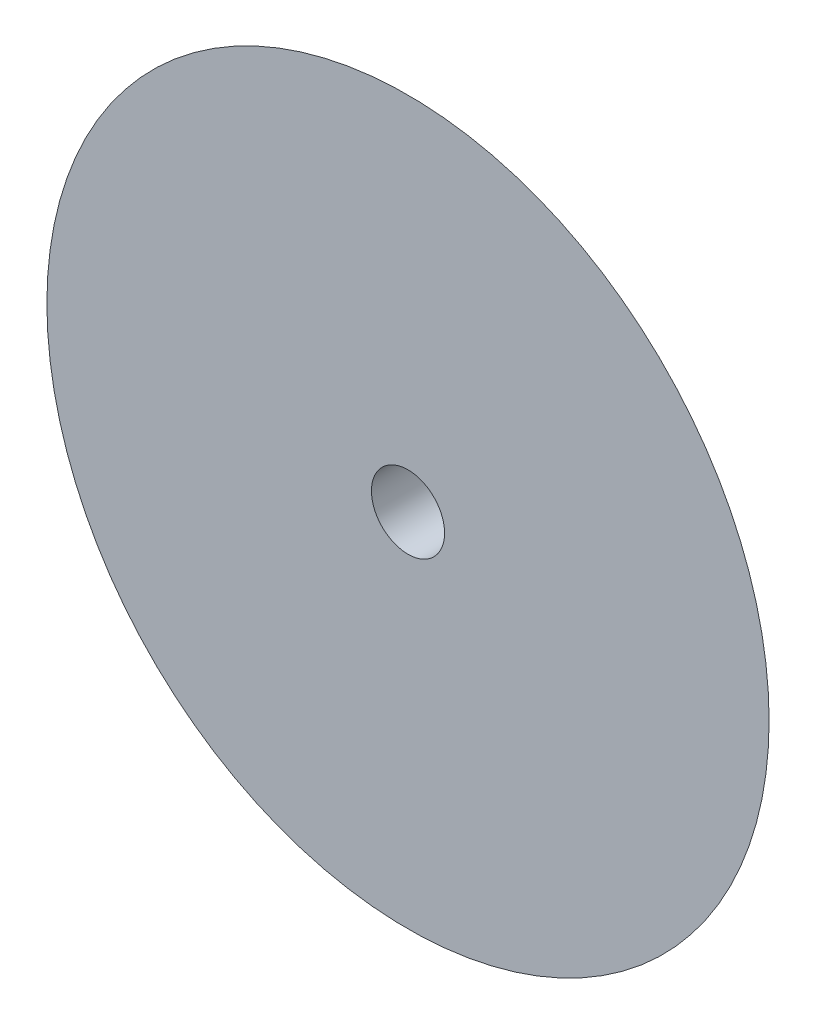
ISO-10303-21;
HEADER;
FILE_DESCRIPTION(('STEP AP214'),'2;1');
FILE_NAME('part.step','',(''),(''),'','','');
FILE_SCHEMA(('AUTOMOTIVE_DESIGN { 1 0 10303 214 1 1 1 1 }'));
ENDSEC;
DATA;
#1=APPLICATION_CONTEXT('core data for automotive mechanical design processes');
#2=APPLICATION_PROTOCOL_DEFINITION('international standard','automotive_design',2000,#1);
#3=PRODUCT_CONTEXT('',#1,'mechanical');
#4=PRODUCT('Part','Part','',(#3));
#5=PRODUCT_RELATED_PRODUCT_CATEGORY('part','',(#4));
#6=PRODUCT_DEFINITION_FORMATION('','',#4);
#7=PRODUCT_DEFINITION_CONTEXT('part definition',#1,'design');
#8=PRODUCT_DEFINITION('design','',#6,#7);
#9=PRODUCT_DEFINITION_SHAPE('','',#8);
#10=(LENGTH_UNIT() NAMED_UNIT(*) SI_UNIT(.MILLI.,.METRE.));
#11=(NAMED_UNIT(*) PLANE_ANGLE_UNIT() SI_UNIT($,.RADIAN.));
#12=(NAMED_UNIT(*) SI_UNIT($,.STERADIAN.) SOLID_ANGLE_UNIT());
#13=UNCERTAINTY_MEASURE_WITH_UNIT(LENGTH_MEASURE(1.E-05),#10,'distance_accuracy_value','');
#14=(GEOMETRIC_REPRESENTATION_CONTEXT(3) GLOBAL_UNCERTAINTY_ASSIGNED_CONTEXT((#13)) GLOBAL_UNIT_ASSIGNED_CONTEXT((#10,
#11,#12)) REPRESENTATION_CONTEXT('',''));
#15=CARTESIAN_POINT('',(0.,0.,0.));
#16=DIRECTION('',(0.,0.,1.));
#17=DIRECTION('',(1.,0.,0.));
#18=AXIS2_PLACEMENT_3D('',#15,#16,#17);
#19=CARTESIAN_POINT('',(0.,0.,36.6743948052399));
#20=DIRECTION('',(0.,0.,1.));
#21=DIRECTION('',(1.,0.,0.));
#22=AXIS2_PLACEMENT_3D('',#19,#20,#21);
#23=DEGENERATE_TOROIDAL_SURFACE('',#22,1.30305823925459,44.45,.F.);
#24=CARTESIAN_POINT('',(0.,0.,0.));
#25=DIRECTION('',(0.,0.,1.));
#26=DIRECTION('',(1.,0.,0.));
#27=AXIS2_PLACEMENT_3D('',#24,#25,#26);
#28=CIRCLE('',#27,23.8125);
#29=CARTESIAN_POINT('',(23.8125,0.,0.));
#30=VERTEX_POINT('',#29);
#31=EDGE_CURVE('E38',#30,#30,#28,.T.);
#32=ORIENTED_EDGE('',*,*,#31,.F.);
#33=EDGE_LOOP('',(#32));
#34=FACE_BOUND('',#33,.T.);
#35=CARTESIAN_POINT('',(0.,0.,-7.35981352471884));
#36=DIRECTION('',(0.,0.,1.));
#37=DIRECTION('',(1.,0.,0.));
#38=AXIS2_PLACEMENT_3D('',#35,#36,#37);
#39=CIRCLE('',#38,4.7625);
#40=CARTESIAN_POINT('',(4.7625,0.,-7.35981352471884));
#41=VERTEX_POINT('',#40);
#42=EDGE_CURVE('E45',#41,#41,#39,.F.);
#43=ORIENTED_EDGE('',*,*,#42,.F.);
#44=EDGE_LOOP('',(#43));
#45=FACE_BOUND('',#44,.T.);
#46=ADVANCED_FACE('F30',(#34,#45),#23,.F.);
#47=CARTESIAN_POINT('',(0.,0.,44.0358695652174));
#48=DIRECTION('',(0.,0.,1.));
#49=DIRECTION('',(1.,0.,0.));
#50=AXIS2_PLACEMENT_3D('',#47,#48,#49);
#51=CYLINDRICAL_SURFACE('',#50,2.413);
#52=CARTESIAN_POINT('',(0.,0.,-3.81));
#53=DIRECTION('',(0.,0.,1.));
#54=DIRECTION('',(1.,0.,0.));
#55=AXIS2_PLACEMENT_3D('',#52,#53,#54);
#56=CIRCLE('',#55,2.413);
#57=CARTESIAN_POINT('',(2.413,0.,-3.81));
#58=VERTEX_POINT('',#57);
#59=EDGE_CURVE('E34',#58,#58,#56,.F.);
#60=ORIENTED_EDGE('',*,*,#59,.T.);
#61=EDGE_LOOP('',(#60));
#62=FACE_BOUND('',#61,.T.);
#63=CARTESIAN_POINT('',(0.,0.,0.));
#64=DIRECTION('',(0.,0.,1.));
#65=DIRECTION('',(1.,0.,0.));
#66=AXIS2_PLACEMENT_3D('',#63,#64,#65);
#67=CIRCLE('',#66,2.413);
#68=CARTESIAN_POINT('',(2.413,0.,0.));
#69=VERTEX_POINT('',#68);
#70=EDGE_CURVE('E10',#69,#69,#67,.T.);
#71=ORIENTED_EDGE('',*,*,#70,.T.);
#72=EDGE_LOOP('',(#71));
#73=FACE_BOUND('',#72,.T.);
#74=ADVANCED_FACE('F32',(#62,#73),#51,.F.);
#75=CARTESIAN_POINT('',(0.,2.413,0.));
#76=DIRECTION('',(0.,0.,-1.));
#77=DIRECTION('',(-1.,0.,0.));
#78=AXIS2_PLACEMENT_3D('',#75,#76,#77);
#79=PLANE('',#78);
#80=ORIENTED_EDGE('',*,*,#70,.F.);
#81=EDGE_LOOP('',(#80));
#82=FACE_BOUND('',#81,.T.);
#83=ORIENTED_EDGE('',*,*,#31,.T.);
#84=EDGE_LOOP('',(#83));
#85=FACE_BOUND('',#84,.T.);
#86=ADVANCED_FACE('F59',(#82,#85),#79,.F.);
#87=CARTESIAN_POINT('',(0.,0.,-3.81));
#88=DIRECTION('',(0.,0.,1.));
#89=DIRECTION('',(1.,0.,0.));
#90=AXIS2_PLACEMENT_3D('',#87,#88,#89);
#91=PLANE('',#90);
#92=CARTESIAN_POINT('',(0.,0.,-3.81));
#93=DIRECTION('',(0.,0.,1.));
#94=DIRECTION('',(1.,0.,0.));
#95=AXIS2_PLACEMENT_3D('',#92,#93,#94);
#96=CIRCLE('',#95,4.7625);
#97=CARTESIAN_POINT('',(4.7625,0.,-3.81));
#98=VERTEX_POINT('',#97);
#99=EDGE_CURVE('E47',#98,#98,#96,.T.);
#100=ORIENTED_EDGE('',*,*,#99,.F.);
#101=EDGE_LOOP('',(#100));
#102=FACE_BOUND('',#101,.T.);
#103=ORIENTED_EDGE('',*,*,#59,.F.);
#104=EDGE_LOOP('',(#103));
#105=FACE_BOUND('',#104,.T.);
#106=ADVANCED_FACE('F56',(#102,#105),#91,.F.);
#107=CARTESIAN_POINT('',(0.,0.,-3.81));
#108=DIRECTION('',(0.,0.,-1.));
#109=DIRECTION('',(-1.,0.,0.));
#110=AXIS2_PLACEMENT_3D('',#107,#108,#109);
#111=CYLINDRICAL_SURFACE('',#110,4.7625);
#112=ORIENTED_EDGE('',*,*,#99,.T.);
#113=EDGE_LOOP('',(#112));
#114=FACE_BOUND('',#113,.T.);
#115=ORIENTED_EDGE('',*,*,#42,.T.);
#116=EDGE_LOOP('',(#115));
#117=FACE_BOUND('',#116,.T.);
#118=ADVANCED_FACE('F54',(#114,#117),#111,.F.);
#119=CLOSED_SHELL('',(#46,#74,#86,#106,#118));
#120=MANIFOLD_SOLID_BREP('B2',#119);
#121=ADVANCED_BREP_SHAPE_REPRESENTATION('',(#18,#120),#14);
#122=SHAPE_DEFINITION_REPRESENTATION(#9,#121);
ENDSEC;
END-ISO-10303-21;
